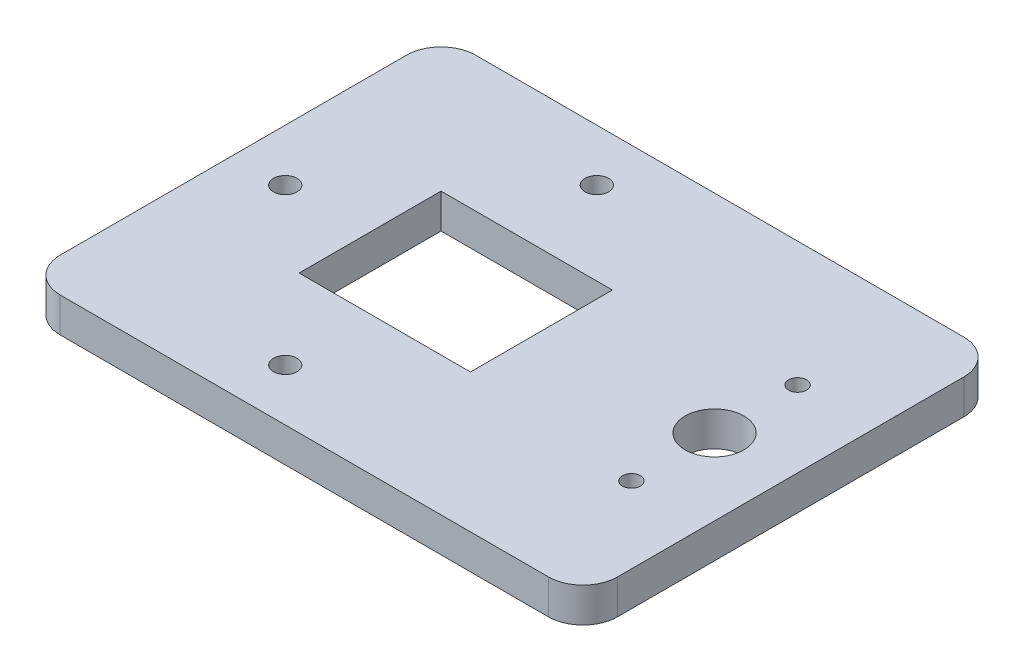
from build123d import *

# Parameters (mm, degrees)
SKETCH_1_W          = 161
SKETCH_1_H          = 120
EXTRUDE_1_DEPTH     = 10
FILLET_1_R          = 10
SKETCH_2_W          = 49.5
SKETCH_2_H          = 41
CUT_EXTRUDE_1_DEPTH = 10
SKETCH_3_R          = 8.5
CUT_EXTRUDE_2_DEPTH = 10
FILLET_2_R          = 10
SKETCH_5_R          = 3.4
CUT_EXTRUDE_4_DEPTH = 118.474465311
SKETCH_6_R          = 2.6
CUT_EXTRUDE_5_DEPTH = 10


with BuildPart() as part:
    # Sketch 1 → Extrude 1 (new body)
    with BuildSketch(Plane(origin=(0, 0, 0), x_dir=(1, 0, 0), z_dir=(0, 1, 0))):
        with Locations((-20, 0)):
            Rectangle(SKETCH_1_W, SKETCH_1_H)
    extrude(amount=EXTRUDE_1_DEPTH)

    # Fillet 1
    fillet_1_edges = [part.edges().sort_by_distance(p)[0] for p in [
        (60.5, 5, 60),
        (60.5, 5, -60),
    ]]
    fillet(fillet_1_edges, radius=FILLET_1_R)

    # Sketch 2 → Cut-Extrude 1 (cut)
    with BuildSketch(Plane(origin=(0, 10, 0), x_dir=(1, 0, 0), z_dir=(0, 1, 0))):
        with Locations((-36.75, 0.5)):
            Rectangle(SKETCH_2_W, SKETCH_2_H)
    extrude(amount=-CUT_EXTRUDE_1_DEPTH, mode=Mode.SUBTRACT)

    # Sketch 3 → Cut-Extrude 2 (cut)
    with BuildSketch(Plane(origin=(0, 10, 0), x_dir=(1, 0, 0), z_dir=(0, 1, 0))):
        with Locations(Location((38.5, 0, 0), (0, 0, 270))):
            Circle(SKETCH_3_R)
    extrude(amount=-CUT_EXTRUDE_2_DEPTH, mode=Mode.SUBTRACT)

    # Fillet 2
    fillet_2_edges = [part.edges().sort_by_distance(p)[0] for p in [
        (-100.5, 5, 60),
        (-100.5, 5, -60),
    ]]
    fillet(fillet_2_edges, radius=FILLET_2_R)

    # Sketch 5 → Cut-Extrude 4 (cut, through all)
    with BuildSketch(Plane.XZ):
        with Locations(Location((-40.5, 45, 0), (0, 0, 270))):
            Circle(SKETCH_5_R)
        with Locations(Location((-85.5, 0, 0), (0, 0, 270))):
            Circle(SKETCH_5_R)
        with Locations(Location((-40.5, -45, 0), (0, 0, 270))):
            Circle(SKETCH_5_R)
    extrude(amount=-CUT_EXTRUDE_4_DEPTH, mode=Mode.SUBTRACT)

    # Sketch 6 → Cut-Extrude 5 (cut)
    with BuildSketch(Plane(origin=(0, 10, 0), x_dir=(1, 0, 0), z_dir=(0, 1, 0))):
        with Locations(Location((38.5, 24, 0), (0, 0, 270))):
            Circle(SKETCH_6_R)
        with Locations(Location((38.5, -24, 0), (0, 0, 270))):
            Circle(SKETCH_6_R)
    extrude(amount=-CUT_EXTRUDE_5_DEPTH, mode=Mode.SUBTRACT)


solid = part.part
